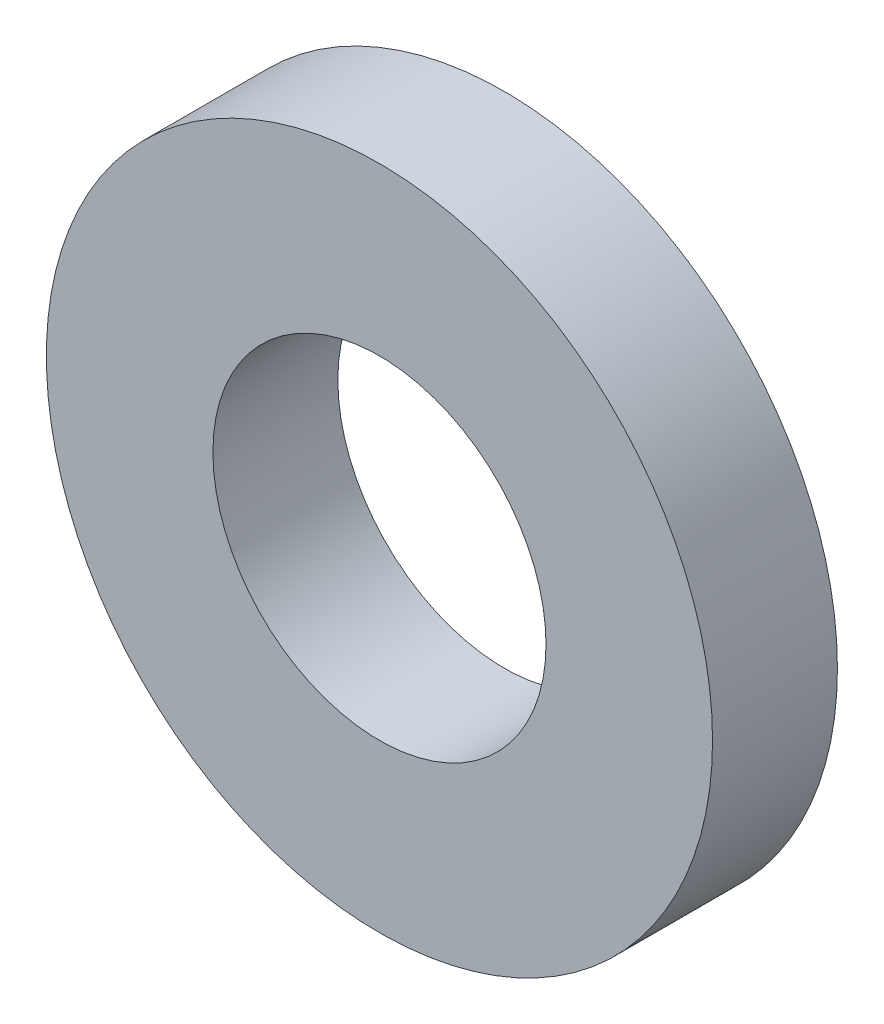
from build123d import *

# Parameters (mm, degrees)
ESQUISSE1_R        = 4
ESQUISSE1_R_2      = 2
BOSS_EXTRU_1_DEPTH = 1.5


with BuildPart() as part:
    # Esquisse1 → Boss.-Extru.1 (new body)
    with BuildSketch(Plane.XY):
        with Locations((39, 44)):
            Circle(ESQUISSE1_R)
        with Locations((39, 44)):
            Circle(ESQUISSE1_R_2, mode=Mode.SUBTRACT)
    extrude(amount=-BOSS_EXTRU_1_DEPTH)


solid = part.part
